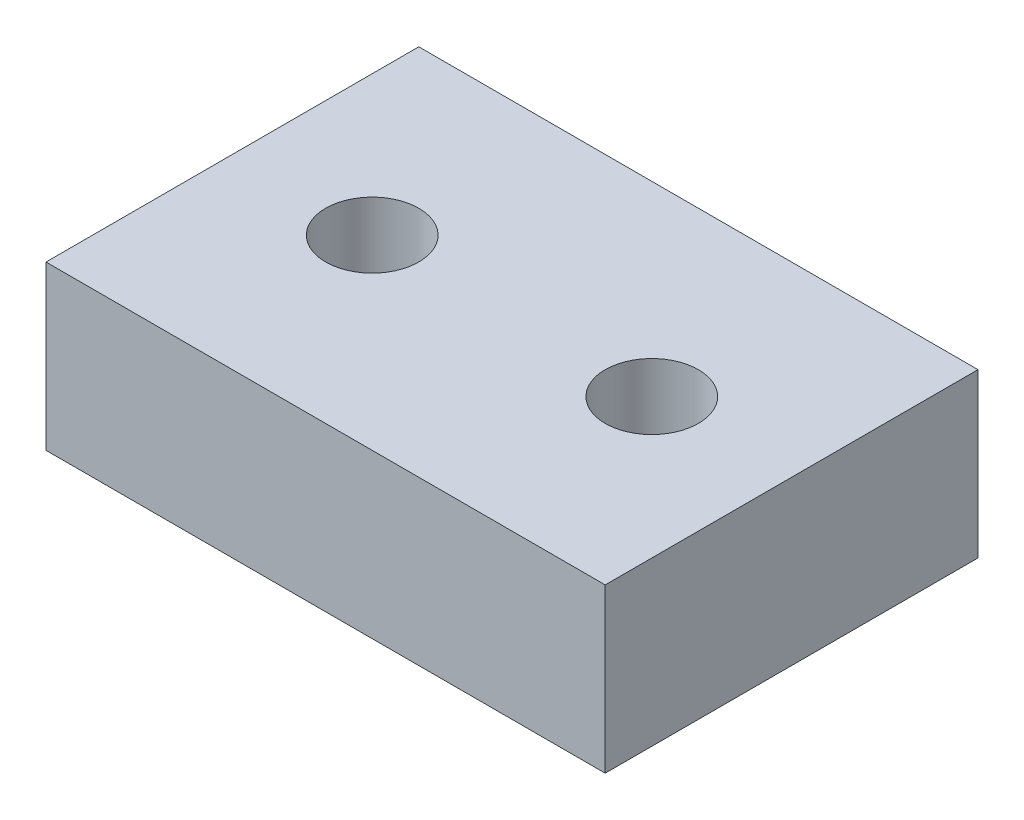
ISO-10303-21;
HEADER;
FILE_DESCRIPTION(('STEP AP214'),'2;1');
FILE_NAME('part.step','',(''),(''),'','','');
FILE_SCHEMA(('AUTOMOTIVE_DESIGN { 1 0 10303 214 1 1 1 1 }'));
ENDSEC;
DATA;
#1=APPLICATION_CONTEXT('core data for automotive mechanical design processes');
#2=APPLICATION_PROTOCOL_DEFINITION('international standard','automotive_design',2000,#1);
#3=PRODUCT_CONTEXT('',#1,'mechanical');
#4=PRODUCT('Part','Part','',(#3));
#5=PRODUCT_RELATED_PRODUCT_CATEGORY('part','',(#4));
#6=PRODUCT_DEFINITION_FORMATION('','',#4);
#7=PRODUCT_DEFINITION_CONTEXT('part definition',#1,'design');
#8=PRODUCT_DEFINITION('design','',#6,#7);
#9=PRODUCT_DEFINITION_SHAPE('','',#8);
#10=(LENGTH_UNIT() NAMED_UNIT(*) SI_UNIT(.MILLI.,.METRE.));
#11=(NAMED_UNIT(*) PLANE_ANGLE_UNIT() SI_UNIT($,.RADIAN.));
#12=(NAMED_UNIT(*) SI_UNIT($,.STERADIAN.) SOLID_ANGLE_UNIT());
#13=UNCERTAINTY_MEASURE_WITH_UNIT(LENGTH_MEASURE(1.E-05),#10,'distance_accuracy_value','');
#14=(GEOMETRIC_REPRESENTATION_CONTEXT(3) GLOBAL_UNCERTAINTY_ASSIGNED_CONTEXT((#13)) GLOBAL_UNIT_ASSIGNED_CONTEXT((#10,
#11,#12)) REPRESENTATION_CONTEXT('',''));
#15=CARTESIAN_POINT('',(0.,0.,0.));
#16=DIRECTION('',(0.,0.,1.));
#17=DIRECTION('',(1.,0.,0.));
#18=AXIS2_PLACEMENT_3D('',#15,#16,#17);
#19=CARTESIAN_POINT('',(0.,0.,50.8));
#20=DIRECTION('',(-1.,0.,0.));
#21=DIRECTION('',(0.,0.,1.));
#22=AXIS2_PLACEMENT_3D('',#19,#20,#21);
#23=PLANE('',#22);
#24=DIRECTION('',(0.,1.,0.));
#25=VECTOR('',#24,1.);
#26=CARTESIAN_POINT('',(0.,0.,0.));
#27=LINE('',#26,#25);
#28=CARTESIAN_POINT('',(0.,0.,0.));
#29=VERTEX_POINT('',#28);
#30=CARTESIAN_POINT('',(0.,22.2250000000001,0.));
#31=VERTEX_POINT('',#30);
#32=EDGE_CURVE('E76',#29,#31,#27,.T.);
#33=ORIENTED_EDGE('',*,*,#32,.F.);
#34=DIRECTION('',(0.,0.,-1.));
#35=VECTOR('',#34,1.);
#36=CARTESIAN_POINT('',(0.,0.,50.8));
#37=LINE('',#36,#35);
#38=CARTESIAN_POINT('',(0.,0.,50.8));
#39=VERTEX_POINT('',#38);
#40=EDGE_CURVE('E11',#39,#29,#37,.T.);
#41=ORIENTED_EDGE('',*,*,#40,.F.);
#42=DIRECTION('',(0.,1.,0.));
#43=VECTOR('',#42,1.);
#44=CARTESIAN_POINT('',(0.,0.,50.8));
#45=LINE('',#44,#43);
#46=CARTESIAN_POINT('',(0.,22.2250000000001,50.8));
#47=VERTEX_POINT('',#46);
#48=EDGE_CURVE('E77',#39,#47,#45,.T.);
#49=ORIENTED_EDGE('',*,*,#48,.T.);
#50=DIRECTION('',(0.,0.,-1.));
#51=VECTOR('',#50,1.);
#52=CARTESIAN_POINT('',(0.,22.2250000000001,50.8));
#53=LINE('',#52,#51);
#54=EDGE_CURVE('E37',#47,#31,#53,.T.);
#55=ORIENTED_EDGE('',*,*,#54,.T.);
#56=EDGE_LOOP('',(#33,#41,#49,#55));
#57=FACE_BOUND('',#56,.T.);
#58=ADVANCED_FACE('F34',(#57),#23,.T.);
#59=CARTESIAN_POINT('',(0.,0.,50.8));
#60=DIRECTION('',(0.,1.,0.));
#61=DIRECTION('',(-1.,0.,0.));
#62=AXIS2_PLACEMENT_3D('',#59,#60,#61);
#63=PLANE('',#62);
#64=CARTESIAN_POINT('',(19.05,0.,25.4));
#65=DIRECTION('',(0.,1.,0.));
#66=DIRECTION('',(-1.,0.,0.));
#67=AXIS2_PLACEMENT_3D('',#64,#65,#66);
#68=CIRCLE('',#67,6.35);
#69=CARTESIAN_POINT('',(12.7,0.,25.4));
#70=VERTEX_POINT('',#69);
#71=EDGE_CURVE('E136',#70,#70,#68,.T.);
#72=ORIENTED_EDGE('',*,*,#71,.T.);
#73=EDGE_LOOP('',(#72));
#74=FACE_BOUND('',#73,.T.);
#75=CARTESIAN_POINT('',(57.15,0.,25.4));
#76=DIRECTION('',(0.,1.,0.));
#77=DIRECTION('',(-1.,0.,0.));
#78=AXIS2_PLACEMENT_3D('',#75,#76,#77);
#79=CIRCLE('',#78,6.35);
#80=CARTESIAN_POINT('',(50.8,0.,25.4));
#81=VERTEX_POINT('',#80);
#82=EDGE_CURVE('E93',#81,#81,#79,.T.);
#83=ORIENTED_EDGE('',*,*,#82,.T.);
#84=EDGE_LOOP('',(#83));
#85=FACE_BOUND('',#84,.T.);
#86=DIRECTION('',(1.,0.,0.));
#87=VECTOR('',#86,1.);
#88=CARTESIAN_POINT('',(0.,0.,0.));
#89=LINE('',#88,#87);
#90=CARTESIAN_POINT('',(76.2,0.,0.));
#91=VERTEX_POINT('',#90);
#92=EDGE_CURVE('E92',#29,#91,#89,.T.);
#93=ORIENTED_EDGE('',*,*,#92,.T.);
#94=DIRECTION('',(0.,0.,-1.));
#95=VECTOR('',#94,1.);
#96=CARTESIAN_POINT('',(76.2,0.,50.8));
#97=LINE('',#96,#95);
#98=CARTESIAN_POINT('',(76.2,0.,50.8));
#99=VERTEX_POINT('',#98);
#100=EDGE_CURVE('E42',#99,#91,#97,.T.);
#101=ORIENTED_EDGE('',*,*,#100,.F.);
#102=DIRECTION('',(1.,0.,0.));
#103=VECTOR('',#102,1.);
#104=CARTESIAN_POINT('',(0.,0.,50.8));
#105=LINE('',#104,#103);
#106=EDGE_CURVE('E55',#39,#99,#105,.T.);
#107=ORIENTED_EDGE('',*,*,#106,.F.);
#108=ORIENTED_EDGE('',*,*,#40,.T.);
#109=EDGE_LOOP('',(#93,#101,#107,#108));
#110=FACE_BOUND('',#109,.T.);
#111=ADVANCED_FACE('F112',(#74,#85,#110),#63,.F.);
#112=CARTESIAN_POINT('',(76.2,22.225,50.8));
#113=DIRECTION('',(1.,0.,0.));
#114=DIRECTION('',(0.,0.,-1.));
#115=AXIS2_PLACEMENT_3D('',#112,#113,#114);
#116=PLANE('',#115);
#117=DIRECTION('',(0.,-1.,0.));
#118=VECTOR('',#117,1.);
#119=CARTESIAN_POINT('',(76.2,22.225,0.));
#120=LINE('',#119,#118);
#121=CARTESIAN_POINT('',(76.2,22.225,0.));
#122=VERTEX_POINT('',#121);
#123=EDGE_CURVE('E87',#122,#91,#120,.T.);
#124=ORIENTED_EDGE('',*,*,#123,.F.);
#125=DIRECTION('',(0.,0.,-1.));
#126=VECTOR('',#125,1.);
#127=CARTESIAN_POINT('',(76.2,22.225,50.8));
#128=LINE('',#127,#126);
#129=CARTESIAN_POINT('',(76.2,22.225,50.8));
#130=VERTEX_POINT('',#129);
#131=EDGE_CURVE('E80',#130,#122,#128,.T.);
#132=ORIENTED_EDGE('',*,*,#131,.F.);
#133=DIRECTION('',(0.,-1.,0.));
#134=VECTOR('',#133,1.);
#135=CARTESIAN_POINT('',(76.2,22.225,50.8));
#136=LINE('',#135,#134);
#137=EDGE_CURVE('E105',#130,#99,#136,.T.);
#138=ORIENTED_EDGE('',*,*,#137,.T.);
#139=ORIENTED_EDGE('',*,*,#100,.T.);
#140=EDGE_LOOP('',(#124,#132,#138,#139));
#141=FACE_BOUND('',#140,.T.);
#142=ADVANCED_FACE('F110',(#141),#116,.T.);
#143=CARTESIAN_POINT('',(76.2,22.225,50.8));
#144=DIRECTION('',(0.,-1.,0.));
#145=DIRECTION('',(1.,0.,0.));
#146=AXIS2_PLACEMENT_3D('',#143,#144,#145);
#147=PLANE('',#146);
#148=CARTESIAN_POINT('',(19.05,22.225,25.4));
#149=DIRECTION('',(0.,1.,0.));
#150=DIRECTION('',(-1.,0.,0.));
#151=AXIS2_PLACEMENT_3D('',#148,#149,#150);
#152=CIRCLE('',#151,6.35);
#153=CARTESIAN_POINT('',(12.7,22.225,25.4));
#154=VERTEX_POINT('',#153);
#155=EDGE_CURVE('E146',#154,#154,#152,.T.);
#156=ORIENTED_EDGE('',*,*,#155,.F.);
#157=EDGE_LOOP('',(#156));
#158=FACE_BOUND('',#157,.T.);
#159=CARTESIAN_POINT('',(57.15,22.225,25.4));
#160=DIRECTION('',(0.,1.,0.));
#161=DIRECTION('',(-1.,0.,0.));
#162=AXIS2_PLACEMENT_3D('',#159,#160,#161);
#163=CIRCLE('',#162,6.35);
#164=CARTESIAN_POINT('',(50.8,22.225,25.4));
#165=VERTEX_POINT('',#164);
#166=EDGE_CURVE('E96',#165,#165,#163,.T.);
#167=ORIENTED_EDGE('',*,*,#166,.F.);
#168=EDGE_LOOP('',(#167));
#169=FACE_BOUND('',#168,.T.);
#170=DIRECTION('',(-1.,0.,0.));
#171=VECTOR('',#170,1.);
#172=CARTESIAN_POINT('',(76.2,22.225,0.));
#173=LINE('',#172,#171);
#174=EDGE_CURVE('E82',#122,#31,#173,.T.);
#175=ORIENTED_EDGE('',*,*,#174,.T.);
#176=ORIENTED_EDGE('',*,*,#54,.F.);
#177=DIRECTION('',(-1.,0.,0.));
#178=VECTOR('',#177,1.);
#179=CARTESIAN_POINT('',(76.2,22.225,50.8));
#180=LINE('',#179,#178);
#181=EDGE_CURVE('E103',#130,#47,#180,.T.);
#182=ORIENTED_EDGE('',*,*,#181,.F.);
#183=ORIENTED_EDGE('',*,*,#131,.T.);
#184=EDGE_LOOP('',(#175,#176,#182,#183));
#185=FACE_BOUND('',#184,.T.);
#186=ADVANCED_FACE('F83',(#158,#169,#185),#147,.F.);
#187=CARTESIAN_POINT('',(0.,0.,50.8));
#188=DIRECTION('',(0.,0.,-1.));
#189=DIRECTION('',(-1.,0.,0.));
#190=AXIS2_PLACEMENT_3D('',#187,#188,#189);
#191=PLANE('',#190);
#192=ORIENTED_EDGE('',*,*,#48,.F.);
#193=ORIENTED_EDGE('',*,*,#106,.T.);
#194=ORIENTED_EDGE('',*,*,#137,.F.);
#195=ORIENTED_EDGE('',*,*,#181,.T.);
#196=EDGE_LOOP('',(#192,#193,#194,#195));
#197=FACE_BOUND('',#196,.T.);
#198=ADVANCED_FACE('F113',(#197),#191,.F.);
#199=CARTESIAN_POINT('',(0.,0.,0.));
#200=DIRECTION('',(0.,0.,-1.));
#201=DIRECTION('',(-1.,0.,0.));
#202=AXIS2_PLACEMENT_3D('',#199,#200,#201);
#203=PLANE('',#202);
#204=ORIENTED_EDGE('',*,*,#32,.T.);
#205=ORIENTED_EDGE('',*,*,#174,.F.);
#206=ORIENTED_EDGE('',*,*,#123,.T.);
#207=ORIENTED_EDGE('',*,*,#92,.F.);
#208=EDGE_LOOP('',(#204,#205,#206,#207));
#209=FACE_BOUND('',#208,.T.);
#210=ADVANCED_FACE('F90',(#209),#203,.T.);
#211=CARTESIAN_POINT('',(57.15,0.,25.4));
#212=DIRECTION('',(0.,1.,0.));
#213=DIRECTION('',(-1.,0.,0.));
#214=AXIS2_PLACEMENT_3D('',#211,#212,#213);
#215=CYLINDRICAL_SURFACE('',#214,6.35);
#216=ORIENTED_EDGE('',*,*,#82,.F.);
#217=EDGE_LOOP('',(#216));
#218=FACE_BOUND('',#217,.T.);
#219=ORIENTED_EDGE('',*,*,#166,.T.);
#220=EDGE_LOOP('',(#219));
#221=FACE_BOUND('',#220,.T.);
#222=ADVANCED_FACE('F120',(#218,#221),#215,.F.);
#223=CARTESIAN_POINT('',(19.05,0.,25.4));
#224=DIRECTION('',(0.,1.,0.));
#225=DIRECTION('',(-1.,0.,0.));
#226=AXIS2_PLACEMENT_3D('',#223,#224,#225);
#227=CYLINDRICAL_SURFACE('',#226,6.35);
#228=ORIENTED_EDGE('',*,*,#71,.F.);
#229=EDGE_LOOP('',(#228));
#230=FACE_BOUND('',#229,.T.);
#231=ORIENTED_EDGE('',*,*,#155,.T.);
#232=EDGE_LOOP('',(#231));
#233=FACE_BOUND('',#232,.T.);
#234=ADVANCED_FACE('F141',(#230,#233),#227,.F.);
#235=CLOSED_SHELL('',(#58,#111,#142,#186,#198,#210,#222,#234));
#236=MANIFOLD_SOLID_BREP('B2',#235);
#237=ADVANCED_BREP_SHAPE_REPRESENTATION('',(#18,#236),#14);
#238=SHAPE_DEFINITION_REPRESENTATION(#9,#237);
ENDSEC;
END-ISO-10303-21;
